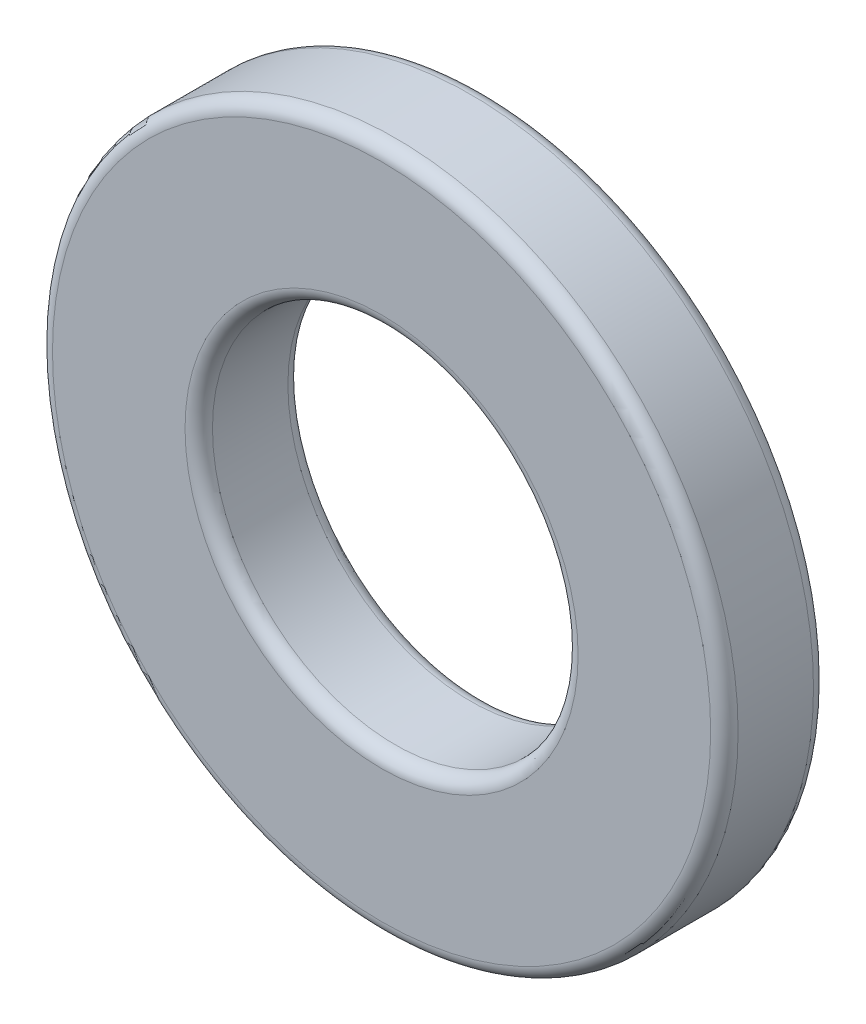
ISO-10303-21;
HEADER;
FILE_DESCRIPTION(('STEP AP214'),'2;1');
FILE_NAME('part.step','',(''),(''),'','','');
FILE_SCHEMA(('AUTOMOTIVE_DESIGN { 1 0 10303 214 1 1 1 1 }'));
ENDSEC;
DATA;
#1=APPLICATION_CONTEXT('core data for automotive mechanical design processes');
#2=APPLICATION_PROTOCOL_DEFINITION('international standard','automotive_design',2000,#1);
#3=PRODUCT_CONTEXT('',#1,'mechanical');
#4=PRODUCT('Part','Part','',(#3));
#5=PRODUCT_RELATED_PRODUCT_CATEGORY('part','',(#4));
#6=PRODUCT_DEFINITION_FORMATION('','',#4);
#7=PRODUCT_DEFINITION_CONTEXT('part definition',#1,'design');
#8=PRODUCT_DEFINITION('design','',#6,#7);
#9=PRODUCT_DEFINITION_SHAPE('','',#8);
#10=(LENGTH_UNIT() NAMED_UNIT(*) SI_UNIT(.MILLI.,.METRE.));
#11=(NAMED_UNIT(*) PLANE_ANGLE_UNIT() SI_UNIT($,.RADIAN.));
#12=(NAMED_UNIT(*) SI_UNIT($,.STERADIAN.) SOLID_ANGLE_UNIT());
#13=UNCERTAINTY_MEASURE_WITH_UNIT(LENGTH_MEASURE(1.E-05),#10,'distance_accuracy_value','');
#14=(GEOMETRIC_REPRESENTATION_CONTEXT(3) GLOBAL_UNCERTAINTY_ASSIGNED_CONTEXT((#13)) GLOBAL_UNIT_ASSIGNED_CONTEXT((#10,
#11,#12)) REPRESENTATION_CONTEXT('',''));
#15=CARTESIAN_POINT('',(0.,0.,0.));
#16=DIRECTION('',(0.,0.,1.));
#17=DIRECTION('',(1.,0.,0.));
#18=AXIS2_PLACEMENT_3D('',#15,#16,#17);
#19=CARTESIAN_POINT('',(0.,0.,-0.9));
#20=DIRECTION('',(0.,0.,1.));
#21=DIRECTION('',(1.,0.,0.));
#22=AXIS2_PLACEMENT_3D('',#19,#20,#21);
#23=CYLINDRICAL_SURFACE('',#22,6.);
#24=CARTESIAN_POINT('',(0.,0.,-0.66));
#25=DIRECTION('',(0.,0.,1.));
#26=DIRECTION('',(1.,0.,0.));
#27=AXIS2_PLACEMENT_3D('',#24,#25,#26);
#28=CIRCLE('',#27,6.);
#29=CARTESIAN_POINT('',(6.,0.,-0.66));
#30=VERTEX_POINT('',#29);
#31=EDGE_CURVE('E75',#30,#30,#28,.T.);
#32=ORIENTED_EDGE('',*,*,#31,.T.);
#33=EDGE_LOOP('',(#32));
#34=FACE_BOUND('',#33,.T.);
#35=CARTESIAN_POINT('',(0.,0.,0.66));
#36=DIRECTION('',(0.,0.,1.));
#37=DIRECTION('',(1.,0.,0.));
#38=AXIS2_PLACEMENT_3D('',#35,#36,#37);
#39=CIRCLE('',#38,6.);
#40=CARTESIAN_POINT('',(6.,0.,0.66));
#41=VERTEX_POINT('',#40);
#42=EDGE_CURVE('E79',#41,#41,#39,.F.);
#43=ORIENTED_EDGE('',*,*,#42,.T.);
#44=EDGE_LOOP('',(#43));
#45=FACE_BOUND('',#44,.T.);
#46=ADVANCED_FACE('F41',(#34,#45),#23,.T.);
#47=CARTESIAN_POINT('',(0.,0.,-0.9));
#48=DIRECTION('',(0.,0.,1.));
#49=DIRECTION('',(1.,0.,0.));
#50=AXIS2_PLACEMENT_3D('',#47,#48,#49);
#51=PLANE('',#50);
#52=CARTESIAN_POINT('',(0.,0.,-0.9));
#53=DIRECTION('',(0.,0.,1.));
#54=DIRECTION('',(1.,0.,0.));
#55=AXIS2_PLACEMENT_3D('',#52,#53,#54);
#56=CIRCLE('',#55,5.76);
#57=CARTESIAN_POINT('',(5.76,0.,-0.9));
#58=VERTEX_POINT('',#57);
#59=EDGE_CURVE('E67',#58,#58,#56,.F.);
#60=ORIENTED_EDGE('',*,*,#59,.T.);
#61=EDGE_LOOP('',(#60));
#62=FACE_BOUND('',#61,.T.);
#63=CARTESIAN_POINT('',(0.,0.,-0.9));
#64=DIRECTION('',(0.,0.,1.));
#65=DIRECTION('',(1.,0.,0.));
#66=AXIS2_PLACEMENT_3D('',#63,#64,#65);
#67=CIRCLE('',#66,3.44);
#68=CARTESIAN_POINT('',(3.44,0.,-0.9));
#69=VERTEX_POINT('',#68);
#70=EDGE_CURVE('E71',#69,#69,#67,.T.);
#71=ORIENTED_EDGE('',*,*,#70,.T.);
#72=EDGE_LOOP('',(#71));
#73=FACE_BOUND('',#72,.T.);
#74=ADVANCED_FACE('F95',(#62,#73),#51,.F.);
#75=CARTESIAN_POINT('',(0.,0.,-0.9));
#76=DIRECTION('',(0.,0.,1.));
#77=DIRECTION('',(1.,0.,0.));
#78=AXIS2_PLACEMENT_3D('',#75,#76,#77);
#79=CYLINDRICAL_SURFACE('',#78,3.2);
#80=CARTESIAN_POINT('',(0.,0.,-0.66));
#81=DIRECTION('',(0.,0.,1.));
#82=DIRECTION('',(1.,0.,0.));
#83=AXIS2_PLACEMENT_3D('',#80,#81,#82);
#84=CIRCLE('',#83,3.2);
#85=CARTESIAN_POINT('',(3.2,0.,-0.66));
#86=VERTEX_POINT('',#85);
#87=EDGE_CURVE('E55',#86,#86,#84,.F.);
#88=ORIENTED_EDGE('',*,*,#87,.T.);
#89=EDGE_LOOP('',(#88));
#90=FACE_BOUND('',#89,.T.);
#91=CARTESIAN_POINT('',(0.,0.,0.66));
#92=DIRECTION('',(0.,0.,1.));
#93=DIRECTION('',(1.,0.,0.));
#94=AXIS2_PLACEMENT_3D('',#91,#92,#93);
#95=CIRCLE('',#94,3.2);
#96=CARTESIAN_POINT('',(3.2,0.,0.66));
#97=VERTEX_POINT('',#96);
#98=EDGE_CURVE('E61',#97,#97,#95,.T.);
#99=ORIENTED_EDGE('',*,*,#98,.T.);
#100=EDGE_LOOP('',(#99));
#101=FACE_BOUND('',#100,.T.);
#102=ADVANCED_FACE('F101',(#90,#101),#79,.F.);
#103=CARTESIAN_POINT('',(0.,0.,0.9));
#104=DIRECTION('',(0.,0.,1.));
#105=DIRECTION('',(1.,0.,0.));
#106=AXIS2_PLACEMENT_3D('',#103,#104,#105);
#107=PLANE('',#106);
#108=CARTESIAN_POINT('',(0.,0.,0.9));
#109=DIRECTION('',(0.,0.,1.));
#110=DIRECTION('',(1.,0.,0.));
#111=AXIS2_PLACEMENT_3D('',#108,#109,#110);
#112=CIRCLE('',#111,3.44);
#113=CARTESIAN_POINT('',(3.44,0.,0.9));
#114=VERTEX_POINT('',#113);
#115=EDGE_CURVE('E10',#114,#114,#112,.F.);
#116=ORIENTED_EDGE('',*,*,#115,.T.);
#117=EDGE_LOOP('',(#116));
#118=FACE_BOUND('',#117,.T.);
#119=CARTESIAN_POINT('',(0.,0.,0.9));
#120=DIRECTION('',(0.,0.,1.));
#121=DIRECTION('',(1.,0.,0.));
#122=AXIS2_PLACEMENT_3D('',#119,#120,#121);
#123=CIRCLE('',#122,5.76);
#124=CARTESIAN_POINT('',(5.76,0.,0.9));
#125=VERTEX_POINT('',#124);
#126=EDGE_CURVE('E49',#125,#125,#123,.T.);
#127=ORIENTED_EDGE('',*,*,#126,.T.);
#128=EDGE_LOOP('',(#127));
#129=FACE_BOUND('',#128,.T.);
#130=ADVANCED_FACE('F109',(#118,#129),#107,.T.);
#131=CARTESIAN_POINT('',(0.,0.,-0.66));
#132=DIRECTION('',(0.,0.,1.));
#133=DIRECTION('',(1.,0.,0.));
#134=AXIS2_PLACEMENT_3D('',#131,#132,#133);
#135=TOROIDAL_SURFACE('',#134,5.76,0.24);
#136=ORIENTED_EDGE('',*,*,#59,.F.);
#137=EDGE_LOOP('',(#136));
#138=FACE_BOUND('',#137,.T.);
#139=ORIENTED_EDGE('',*,*,#31,.F.);
#140=EDGE_LOOP('',(#139));
#141=FACE_BOUND('',#140,.T.);
#142=ADVANCED_FACE('F106',(#138,#141),#135,.T.);
#143=CARTESIAN_POINT('',(0.,0.,-0.66));
#144=DIRECTION('',(0.,0.,1.));
#145=DIRECTION('',(1.,0.,0.));
#146=AXIS2_PLACEMENT_3D('',#143,#144,#145);
#147=TOROIDAL_SURFACE('',#146,3.44,0.24);
#148=ORIENTED_EDGE('',*,*,#87,.F.);
#149=EDGE_LOOP('',(#148));
#150=FACE_BOUND('',#149,.T.);
#151=ORIENTED_EDGE('',*,*,#70,.F.);
#152=EDGE_LOOP('',(#151));
#153=FACE_BOUND('',#152,.T.);
#154=ADVANCED_FACE('F92',(#150,#153),#147,.T.);
#155=CARTESIAN_POINT('',(0.,0.,0.66));
#156=DIRECTION('',(0.,0.,1.));
#157=DIRECTION('',(1.,0.,0.));
#158=AXIS2_PLACEMENT_3D('',#155,#156,#157);
#159=TOROIDAL_SURFACE('',#158,3.44,0.24);
#160=ORIENTED_EDGE('',*,*,#115,.F.);
#161=EDGE_LOOP('',(#160));
#162=FACE_BOUND('',#161,.T.);
#163=ORIENTED_EDGE('',*,*,#98,.F.);
#164=EDGE_LOOP('',(#163));
#165=FACE_BOUND('',#164,.T.);
#166=ADVANCED_FACE('F88',(#162,#165),#159,.T.);
#167=CARTESIAN_POINT('',(0.,0.,0.66));
#168=DIRECTION('',(0.,0.,1.));
#169=DIRECTION('',(1.,0.,0.));
#170=AXIS2_PLACEMENT_3D('',#167,#168,#169);
#171=TOROIDAL_SURFACE('',#170,5.76,0.24);
#172=ORIENTED_EDGE('',*,*,#42,.F.);
#173=EDGE_LOOP('',(#172));
#174=FACE_BOUND('',#173,.T.);
#175=ORIENTED_EDGE('',*,*,#126,.F.);
#176=EDGE_LOOP('',(#175));
#177=FACE_BOUND('',#176,.T.);
#178=ADVANCED_FACE('F43',(#174,#177),#171,.T.);
#179=CLOSED_SHELL('',(#46,#74,#102,#130,#142,#154,#166,#178));
#180=MANIFOLD_SOLID_BREP('B2',#179);
#181=ADVANCED_BREP_SHAPE_REPRESENTATION('',(#18,#180),#14);
#182=SHAPE_DEFINITION_REPRESENTATION(#9,#181);
ENDSEC;
END-ISO-10303-21;
